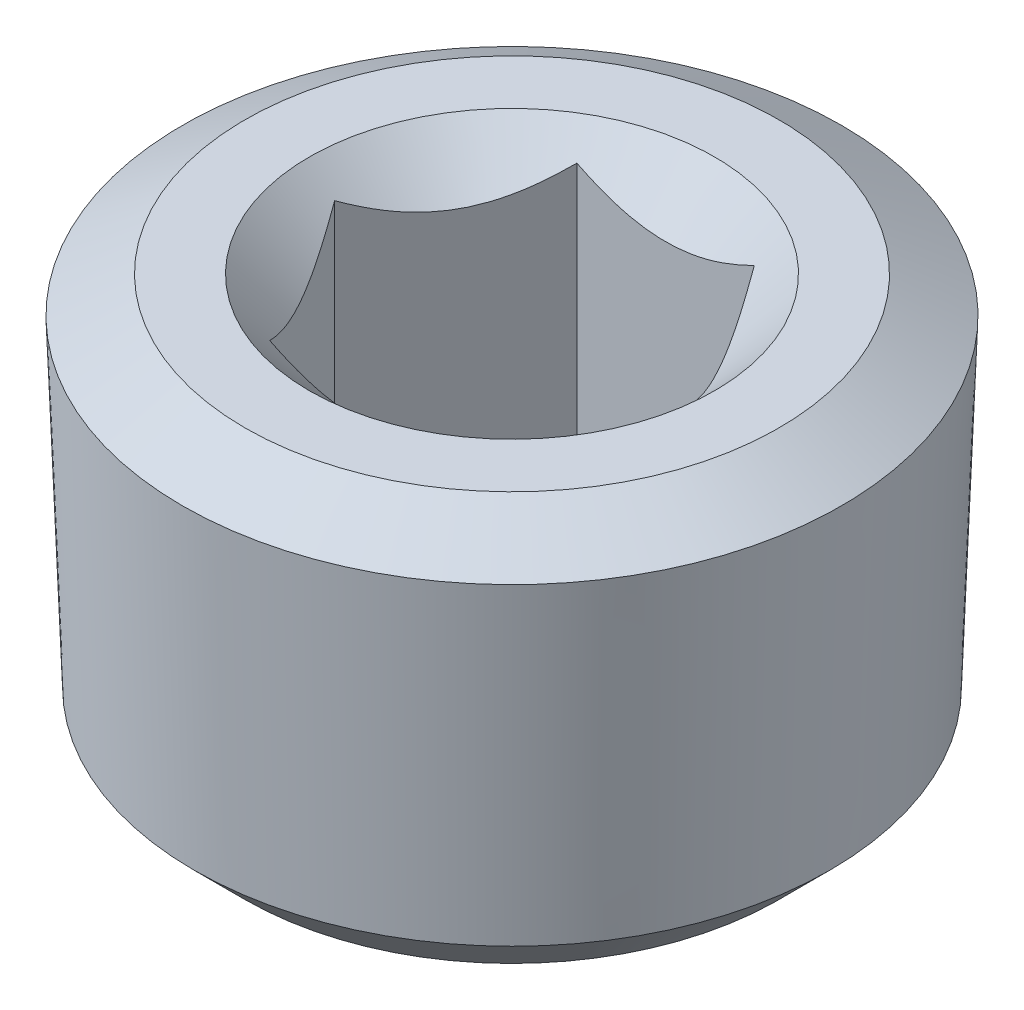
from build123d import *

# Parameters (mm, degrees)
CUT_EXTRUDE1_START = -4.318
CUT_EXTRUDE1_DEPTH = 3.925364


with BuildPart() as part:
    # Sketch2 → Revolve1 (revolve)
    with BuildSketch(Plane.XY, mode=Mode.PRIVATE) as revolve1_sk:
        Polygon((0, 0), (-4.149987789, 0), (-5.1230183, -0.561779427), (-4.940820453, -5.559167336), (-4.149987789, -6.35), (0, -6.35), align=None)
    revolve(revolve1_sk.sketch.rotate(Axis((0, 10.744282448, 0), (0, -1, 0)), 270), axis=Axis((0, 10.744282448, 0), (0, -1, 0)))

    # Sketch3 → Cut-Revolve1 (revolve, cut)
    with BuildSketch(Plane.XY, mode=Mode.PRIVATE) as cut_revolve1_sk:
        Polygon((0, 0), (-3.1496, 0), (-2.3876, -0.762), (-2.3876, -4.318), (-1.119419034, -5.08), (0, -5.08), align=None)
    revolve(cut_revolve1_sk.sketch.rotate(Axis((0, 2.934222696, 0), (0, -1, 0)), 270), axis=Axis((0, 2.934222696, 0), (0, -1, 0)), mode=Mode.SUBTRACT)

    # Sketch4 → Cut-Extrude1 (cut)
    with BuildSketch(Plane(origin=(0, 0, 0), x_dir=(1, 0, 0), z_dir=(0, 1, 0)).offset(CUT_EXTRUDE1_START)):
        Polygon((-1.378481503, -2.3876), (1.378481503, -2.3876), (2.756963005, 0), (1.378481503, 2.3876), (-1.378481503, 2.3876), (-2.756963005, 0), align=None)
    extrude(amount=CUT_EXTRUDE1_DEPTH, mode=Mode.SUBTRACT)


solid = part.part
